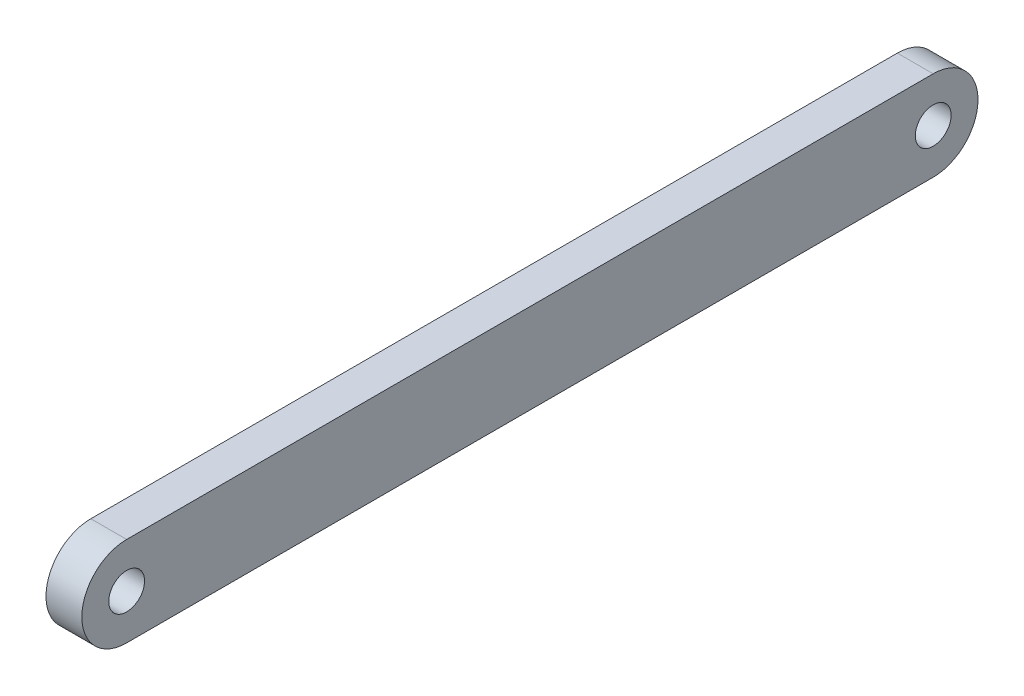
from build123d import *

# Parameters (mm, degrees)
SKETCH1_R           = 18
BOSS_EXTRUDE1_DEPTH = 36


with BuildPart() as part:
    # Sketch1 → Boss-Extrude1 (new body)
    with BuildSketch(Plane(origin=(0, 0, 0), x_dir=(0, 0, -1), z_dir=(1, 0, 0))):
        with BuildLine():
            Line((0, 45), (810, 45))
            ThreePointArc((810, 45), (855, 0), (810, -45))
            Line((810, -45), (0, -45))
            ThreePointArc((0, -45), (-45, 0), (0, 45))
        make_face()
        Circle(SKETCH1_R, mode=Mode.SUBTRACT)
        with Locations((810, 0)):
            Circle(SKETCH1_R, mode=Mode.SUBTRACT)
    extrude(amount=-BOSS_EXTRUDE1_DEPTH)


solid = part.part
